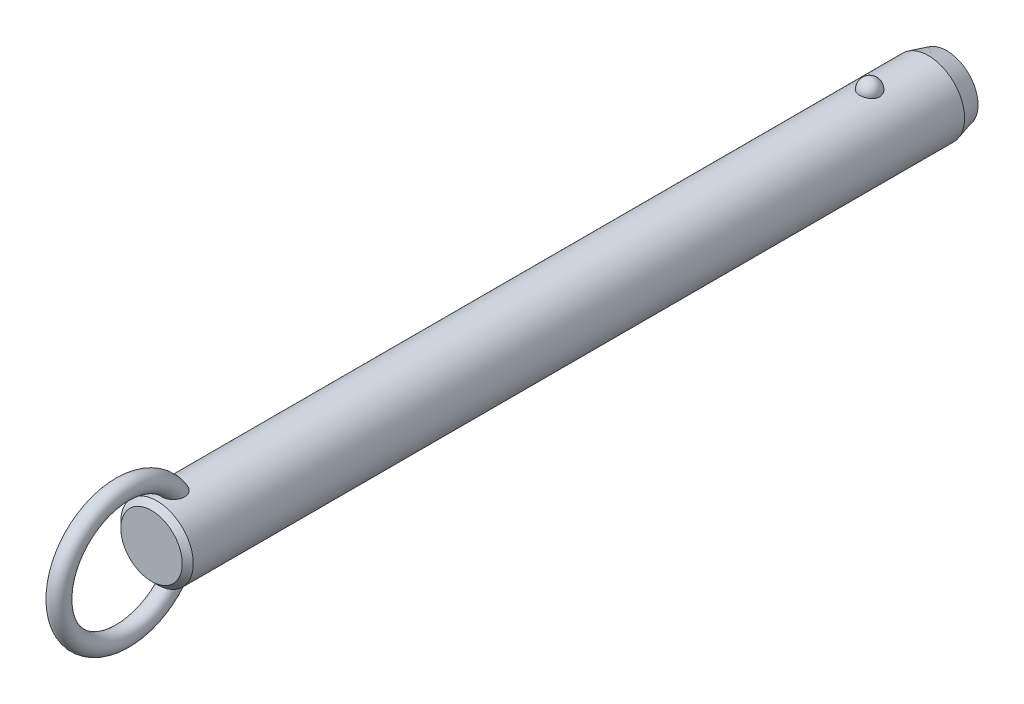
ISO-10303-21;
HEADER;
FILE_DESCRIPTION(('STEP AP214'),'2;1');
FILE_NAME('part.step','',(''),(''),'','','');
FILE_SCHEMA(('AUTOMOTIVE_DESIGN { 1 0 10303 214 1 1 1 1 }'));
ENDSEC;
DATA;
#1=APPLICATION_CONTEXT('core data for automotive mechanical design processes');
#2=APPLICATION_PROTOCOL_DEFINITION('international standard','automotive_design',2000,#1);
#3=PRODUCT_CONTEXT('',#1,'mechanical');
#4=PRODUCT('Part','Part','',(#3));
#5=PRODUCT_RELATED_PRODUCT_CATEGORY('part','',(#4));
#6=PRODUCT_DEFINITION_FORMATION('','',#4);
#7=PRODUCT_DEFINITION_CONTEXT('part definition',#1,'design');
#8=PRODUCT_DEFINITION('design','',#6,#7);
#9=PRODUCT_DEFINITION_SHAPE('','',#8);
#10=(LENGTH_UNIT() NAMED_UNIT(*) SI_UNIT(.MILLI.,.METRE.));
#11=(NAMED_UNIT(*) PLANE_ANGLE_UNIT() SI_UNIT($,.RADIAN.));
#12=(NAMED_UNIT(*) SI_UNIT($,.STERADIAN.) SOLID_ANGLE_UNIT());
#13=UNCERTAINTY_MEASURE_WITH_UNIT(LENGTH_MEASURE(1.E-05),#10,'distance_accuracy_value','');
#14=(GEOMETRIC_REPRESENTATION_CONTEXT(3) GLOBAL_UNCERTAINTY_ASSIGNED_CONTEXT((#13)) GLOBAL_UNIT_ASSIGNED_CONTEXT((#10,
#11,#12)) REPRESENTATION_CONTEXT('',''));
#15=CARTESIAN_POINT('',(0.,0.,0.));
#16=DIRECTION('',(0.,0.,1.));
#17=DIRECTION('',(1.,0.,0.));
#18=AXIS2_PLACEMENT_3D('',#15,#16,#17);
#19=CARTESIAN_POINT('',(0.,0.,144.8));
#20=DIRECTION('',(0.,0.,-1.));
#21=DIRECTION('',(-1.,0.,0.));
#22=AXIS2_PLACEMENT_3D('',#19,#20,#21);
#23=CYLINDRICAL_SURFACE('',#22,7.9);
#24=CARTESIAN_POINT('',(2.1785689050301,7.59367088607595,-2.19999999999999));
#25=CARTESIAN_POINT('',(2.17856679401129,7.59367269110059,-2.07701843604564));
#26=CARTESIAN_POINT('',(2.16853481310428,7.59657145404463,-1.95401006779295));
#27=CARTESIAN_POINT('',(2.12864689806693,7.607843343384,-1.71147811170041));
#28=CARTESIAN_POINT('',(2.09878338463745,7.61621856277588,-1.59195587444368));
#29=CARTESIAN_POINT('',(2.0199931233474,7.63749180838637,-1.3598563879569));
#30=CARTESIAN_POINT('',(1.97107475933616,7.65038784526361,-1.24727610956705));
#31=CARTESIAN_POINT('',(1.85539377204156,7.67926115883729,-1.03213234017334));
#32=CARTESIAN_POINT('',(1.78863158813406,7.69523835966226,-0.929568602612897));
#33=CARTESIAN_POINT('',(1.63856494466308,7.7285848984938,-0.736786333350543));
#34=CARTESIAN_POINT('',(1.55518140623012,7.7459606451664,-0.646630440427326));
#35=CARTESIAN_POINT('',(1.37422937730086,7.78009978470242,-0.481747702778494));
#36=CARTESIAN_POINT('',(1.27666086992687,7.79686317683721,-0.407020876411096));
#37=CARTESIAN_POINT('',(1.07024728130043,7.82786153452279,-0.275278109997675));
#38=CARTESIAN_POINT('',(0.961434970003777,7.84210353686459,-0.218212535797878));
#39=CARTESIAN_POINT('',(0.735351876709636,7.86652194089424,-0.123146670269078));
#40=CARTESIAN_POINT('',(0.618082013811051,7.87669878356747,-0.0851443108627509));
#41=CARTESIAN_POINT('',(0.380637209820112,7.89170521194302,-0.0298158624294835));
#42=CARTESIAN_POINT('',(0.260550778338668,7.89662650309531,-0.0121347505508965));
#43=CARTESIAN_POINT('',(0.019011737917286,7.90090003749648,0.00324379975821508));
#44=CARTESIAN_POINT('',(-0.10244074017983,7.90025280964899,0.000943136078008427));
#45=CARTESIAN_POINT('',(-0.341452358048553,7.89351056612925,-0.0233955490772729));
#46=CARTESIAN_POINT('',(-0.459042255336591,7.88749257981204,-0.0451545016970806));
#47=CARTESIAN_POINT('',(-0.688796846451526,7.87075812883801,-0.107408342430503));
#48=CARTESIAN_POINT('',(-0.800961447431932,7.86004158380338,-0.147903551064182));
#49=CARTESIAN_POINT('',(-1.01743634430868,7.83497131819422,-0.246799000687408));
#50=CARTESIAN_POINT('',(-1.12169791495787,7.82059709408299,-0.305300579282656));
#51=CARTESIAN_POINT('',(-1.31891765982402,7.78976470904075,-0.43854939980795));
#52=CARTESIAN_POINT('',(-1.41187469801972,7.77330633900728,-0.513298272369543));
#53=CARTESIAN_POINT('',(-1.58577142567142,7.73972434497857,-0.678622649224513));
#54=CARTESIAN_POINT('',(-1.66645140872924,7.72259402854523,-0.769470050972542));
#55=CARTESIAN_POINT('',(-1.81161503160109,7.68983776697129,-0.963538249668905));
#56=CARTESIAN_POINT('',(-1.87609753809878,7.6742119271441,-1.06675991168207));
#57=CARTESIAN_POINT('',(-1.98790138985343,7.6460202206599,-1.28401170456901));
#58=CARTESIAN_POINT('',(-2.03501994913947,7.63349104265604,-1.39815107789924));
#59=CARTESIAN_POINT('',(-2.10986724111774,7.6131449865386,-1.63301784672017));
#60=CARTESIAN_POINT('',(-2.1375965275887,7.60532797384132,-1.75374505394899));
#61=CARTESIAN_POINT('',(-2.17289256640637,7.5953195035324,-1.99782562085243));
#62=CARTESIAN_POINT('',(-2.18054294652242,7.59310471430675,-2.12116592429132));
#63=CARTESIAN_POINT('',(-2.17572919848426,7.59448538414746,-2.36741799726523));
#64=CARTESIAN_POINT('',(-2.1632656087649,7.59808068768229,-2.49032977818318));
#65=CARTESIAN_POINT('',(-2.11865035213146,7.61064035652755,-2.73161015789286));
#66=CARTESIAN_POINT('',(-2.08659579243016,7.61957823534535,-2.84999812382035));
#67=CARTESIAN_POINT('',(-2.00367799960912,7.64179982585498,-3.07955956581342));
#68=CARTESIAN_POINT('',(-1.9528140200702,7.65508371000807,-3.19073275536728));
#69=CARTESIAN_POINT('',(-1.83321113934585,7.68460381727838,-3.40337899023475));
#70=CARTESIAN_POINT('',(-1.76437735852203,7.70085556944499,-3.50479651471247));
#71=CARTESIAN_POINT('',(-1.61069526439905,7.73445734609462,-3.69446912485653));
#72=CARTESIAN_POINT('',(-1.52584634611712,7.75180741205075,-3.78272371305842));
#73=CARTESIAN_POINT('',(-1.34198059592,7.78574608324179,-3.94393987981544));
#74=CARTESIAN_POINT('',(-1.24291308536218,7.80233167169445,-4.01684434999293));
#75=CARTESIAN_POINT('',(-1.03352039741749,7.83281625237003,-4.14489386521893));
#76=CARTESIAN_POINT('',(-0.923196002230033,7.84671543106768,-4.20004014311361));
#77=CARTESIAN_POINT('',(-0.69582211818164,7.87011575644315,-4.29042017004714));
#78=CARTESIAN_POINT('',(-0.578872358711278,7.87966903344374,-4.32589112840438));
#79=CARTESIAN_POINT('',(-0.34041023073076,7.8935652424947,-4.37692226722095));
#80=CARTESIAN_POINT('',(-0.218898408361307,7.89790879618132,-4.39248482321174));
#81=CARTESIAN_POINT('',(0.0228107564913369,7.90087453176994,-4.40314405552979));
#82=CARTESIAN_POINT('',(0.142990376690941,7.89960185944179,-4.39861683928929));
#83=CARTESIAN_POINT('',(0.380829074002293,7.89171262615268,-4.37008293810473));
#84=CARTESIAN_POINT('',(0.498488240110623,7.8850962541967,-4.34607694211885));
#85=CARTESIAN_POINT('',(0.727535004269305,7.86726442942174,-4.27939317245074));
#86=CARTESIAN_POINT('',(0.838944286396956,7.85606616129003,-4.236785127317));
#87=CARTESIAN_POINT('',(1.05295421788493,7.83025654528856,-4.13408348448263));
#88=CARTESIAN_POINT('',(1.15555431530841,7.81564498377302,-4.07398879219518));
#89=CARTESIAN_POINT('',(1.35076763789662,7.7843022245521,-3.93687432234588));
#90=CARTESIAN_POINT('',(1.4432046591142,7.76754209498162,-3.85961036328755));
#91=CARTESIAN_POINT('',(1.6139111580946,7.73387857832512,-3.69076949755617));
#92=CARTESIAN_POINT('',(1.6921781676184,7.71697516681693,-3.59919010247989));
#93=CARTESIAN_POINT('',(1.83380875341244,7.6845643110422,-3.40247278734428));
#94=CARTESIAN_POINT('',(1.89689280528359,7.66908588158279,-3.29712873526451));
#95=CARTESIAN_POINT('',(2.0047823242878,7.64159441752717,-3.07707931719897));
#96=CARTESIAN_POINT('',(2.0495945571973,7.62958010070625,-2.96237743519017));
#97=CARTESIAN_POINT('',(2.11580183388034,7.61146617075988,-2.74040519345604));
#98=CARTESIAN_POINT('',(2.13929812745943,7.60484503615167,-2.63379846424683));
#99=CARTESIAN_POINT('',(2.17068242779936,7.59594664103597,-2.41813481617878));
#100=CARTESIAN_POINT('',(2.17857077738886,7.59366928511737,-2.30907795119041));
#101=CARTESIAN_POINT('',(2.1785689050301,7.59367088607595,-2.19999999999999));
#102=B_SPLINE_CURVE_WITH_KNOTS('',3,(#24,#25,#26,#27,#28,#29,#30,#31,#32,#33,#34,#35,#36,#37,
#38,#39,#40,#41,#42,#43,#44,#45,#46,#47,#48,#49,#50,#51,#52,#53,#54,#55,#56,#57,#58,#59,#60,#61,
#62,#63,#64,#65,#66,#67,#68,#69,#70,#71,#72,#73,#74,#75,#76,#77,#78,#79,#80,#81,#82,#83,#84,#85,
#86,#87,#88,#89,#90,#91,#92,#93,#94,#95,#96,#97,#98,#99,#100,#101),.UNSPECIFIED.,.T.,.F.,(4,2,2,
2,2,2,2,2,2,2,2,2,2,2,2,2,2,2,2,2,2,2,2,2,2,2,2,2,2,2,2,2,2,2,2,2,2,2,4),(0.,0.368552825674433,
0.737246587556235,1.10577831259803,1.4743009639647,1.84462067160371,2.21494081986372,
2.58421058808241,2.95344028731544,3.31611630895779,3.67875788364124,4.03628044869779,
4.39380913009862,4.75338791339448,5.11300280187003,5.47939989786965,5.8458226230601,
6.21639834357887,6.58696347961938,6.95598276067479,7.32499216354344,7.69218715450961,
8.0593967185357,8.42858578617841,8.79778880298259,9.16834203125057,9.5388695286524,
9.90482699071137,10.2707407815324,10.6298333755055,10.9889132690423,11.3466585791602,
11.7044262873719,12.0676511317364,12.4309391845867,12.8004764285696,13.1698767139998,
13.4967701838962,13.8236564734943),.UNSPECIFIED.);
#103=CARTESIAN_POINT('',(2.1785689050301,7.59367088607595,-2.19999999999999));
#104=VERTEX_POINT('',#103);
#105=EDGE_CURVE('E41',#104,#104,#102,.T.);
#106=ORIENTED_EDGE('',*,*,#105,.T.);
#107=EDGE_LOOP('',(#106));
#108=FACE_BOUND('',#107,.T.);
#109=CARTESIAN_POINT('',(0.,0.,153.12));
#110=DIRECTION('',(0.,0.,1.));
#111=DIRECTION('',(1.,0.,0.));
#112=AXIS2_PLACEMENT_3D('',#109,#110,#111);
#113=CIRCLE('',#112,7.9);
#114=CARTESIAN_POINT('',(-7.90000000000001,0.,153.12));
#115=VERTEX_POINT('',#114);
#116=EDGE_CURVE('E10',#115,#115,#113,.F.);
#117=ORIENTED_EDGE('',*,*,#116,.T.);
#118=EDGE_LOOP('',(#117));
#119=FACE_BOUND('',#118,.T.);
#120=CARTESIAN_POINT('',(-0.630969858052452,-7.87476203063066,147.012432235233));
#121=CARTESIAN_POINT('',(-0.734180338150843,-7.86648998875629,147.047285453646));
#122=CARTESIAN_POINT('',(-0.834476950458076,-7.85639291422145,147.090816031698));
#123=CARTESIAN_POINT('',(-1.02620356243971,-7.83366343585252,147.194094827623));
#124=CARTESIAN_POINT('',(-1.1176141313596,-7.82102565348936,147.253877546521));
#125=CARTESIAN_POINT('',(-1.28877277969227,-7.79464922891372,147.387839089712));
#126=CARTESIAN_POINT('',(-1.36854014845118,-7.78091246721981,147.461993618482));
#127=CARTESIAN_POINT('',(-1.51461521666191,-7.75380398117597,147.622494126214));
#128=CARTESIAN_POINT('',(-1.58092966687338,-7.74043207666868,147.708833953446));
#129=CARTESIAN_POINT('',(-1.70019064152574,-7.7151252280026,147.892978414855));
#130=CARTESIAN_POINT('',(-1.75284037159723,-7.70322473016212,147.990979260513));
#131=CARTESIAN_POINT('',(-1.84263464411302,-7.68224112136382,148.194102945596));
#132=CARTESIAN_POINT('',(-1.87977299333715,-7.6731591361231,148.299228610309));
#133=CARTESIAN_POINT('',(-1.94152728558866,-7.65777930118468,148.523284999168));
#134=CARTESIAN_POINT('',(-1.96475471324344,-7.65179654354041,148.642616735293));
#135=CARTESIAN_POINT('',(-1.99449499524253,-7.64409642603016,148.88342986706));
#136=CARTESIAN_POINT('',(-2.0010005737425,-7.64238092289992,149.004912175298));
#137=CARTESIAN_POINT('',(-1.99856014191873,-7.64302120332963,149.268340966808));
#138=CARTESIAN_POINT('',(-1.98680021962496,-7.64611845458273,149.41025654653));
#139=CARTESIAN_POINT('',(-1.94457772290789,-7.65696186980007,149.691118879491));
#140=CARTESIAN_POINT('',(-1.91409393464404,-7.66471330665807,149.830062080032));
#141=CARTESIAN_POINT('',(-1.82768670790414,-7.68582947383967,150.131939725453));
#142=CARTESIAN_POINT('',(-1.76772963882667,-7.70003779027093,150.293686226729));
#143=CARTESIAN_POINT('',(-1.65998501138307,-7.72371550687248,150.527695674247));
#144=CARTESIAN_POINT('',(-1.621079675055,-7.73200670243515,150.604297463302));
#145=CARTESIAN_POINT('',(-1.53727726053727,-7.74910377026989,150.754079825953));
#146=CARTESIAN_POINT('',(-1.49238215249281,-7.75790947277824,150.827261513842));
#147=CARTESIAN_POINT('',(-1.37397050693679,-7.77993338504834,151.00288382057));
#148=CARTESIAN_POINT('',(-1.29690364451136,-7.79328473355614,151.102955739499));
#149=CARTESIAN_POINT('',(-1.1288548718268,-7.81939266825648,151.290714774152));
#150=CARTESIAN_POINT('',(-1.0378992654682,-7.83215032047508,151.378424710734));
#151=CARTESIAN_POINT('',(-0.86953281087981,-7.85231710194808,151.513414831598));
#152=CARTESIAN_POINT('',(-0.795716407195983,-7.86021093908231,151.565076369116));
#153=CARTESIAN_POINT('',(-0.640813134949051,-7.87434920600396,151.656381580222));
#154=CARTESIAN_POINT('',(-0.559737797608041,-7.88059619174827,151.69604389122));
#155=CARTESIAN_POINT('',(-0.406456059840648,-7.88984116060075,151.754300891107));
#156=CARTESIAN_POINT('',(-0.335227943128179,-7.89321892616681,151.775384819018));
#157=CARTESIAN_POINT('',(-0.190193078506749,-7.89804235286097,151.80541418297));
#158=CARTESIAN_POINT('',(-0.11638863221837,-7.89948969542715,151.814370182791));
#159=CARTESIAN_POINT('',(0.0318414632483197,-7.90028409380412,151.819291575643));
#160=CARTESIAN_POINT('',(0.106268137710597,-7.89962640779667,151.815227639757));
#161=CARTESIAN_POINT('',(0.253290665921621,-7.8962818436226,151.794461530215));
#162=CARTESIAN_POINT('',(0.325885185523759,-7.8935935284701,151.777750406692));
#163=CARTESIAN_POINT('',(0.481441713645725,-7.88577340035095,151.728738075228));
#164=CARTESIAN_POINT('',(0.563611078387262,-7.88026321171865,151.694005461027));
#165=CARTESIAN_POINT('',(0.721129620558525,-7.86741729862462,151.611796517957));
#166=CARTESIAN_POINT('',(0.796466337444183,-7.86007832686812,151.564297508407));
#167=CARTESIAN_POINT('',(0.971456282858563,-7.84073285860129,151.436513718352));
#168=CARTESIAN_POINT('',(1.0671968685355,-7.82809461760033,151.351004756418));
#169=CARTESIAN_POINT('',(1.24418921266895,-7.80192439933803,151.166232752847));
#170=CARTESIAN_POINT('',(1.32540832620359,-7.78839049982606,151.066939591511));
#171=CARTESIAN_POINT('',(1.45199971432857,-7.76559693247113,150.889576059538));
#172=CARTESIAN_POINT('',(1.5008564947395,-7.75626094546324,150.813954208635));
#173=CARTESIAN_POINT('',(1.59197749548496,-7.7380727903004,150.658742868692));
#174=CARTESIAN_POINT('',(1.63423919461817,-7.72922080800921,150.579151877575));
#175=CARTESIAN_POINT('',(1.71222612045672,-7.71231959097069,150.416664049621));
#176=CARTESIAN_POINT('',(1.74794516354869,-7.70427111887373,150.333764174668));
#177=CARTESIAN_POINT('',(1.81270113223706,-7.68929240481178,150.165296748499));
#178=CARTESIAN_POINT('',(1.84173789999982,-7.68236218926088,150.079729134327));
#179=CARTESIAN_POINT('',(1.89322698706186,-7.6698375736,149.90528702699));
#180=CARTESIAN_POINT('',(1.91558744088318,-7.66426199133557,149.816383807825));
#181=CARTESIAN_POINT('',(1.95281367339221,-7.65485915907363,149.636969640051));
#182=CARTESIAN_POINT('',(1.96767946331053,-7.65103190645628,149.546458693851));
#183=CARTESIAN_POINT('',(2.00021456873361,-7.64262981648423,149.273732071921));
#184=CARTESIAN_POINT('',(2.00600691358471,-7.6410871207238,149.089709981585));
#185=CARTESIAN_POINT('',(1.98445334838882,-7.64669564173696,148.776501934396));
#186=CARTESIAN_POINT('',(1.96607186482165,-7.65149688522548,148.646618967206));
#187=CARTESIAN_POINT('',(1.90884967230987,-7.6659762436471,148.391632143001));
#188=CARTESIAN_POINT('',(1.87002101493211,-7.67565148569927,148.266525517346));
#189=CARTESIAN_POINT('',(1.77063986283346,-7.69918471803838,148.02454013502));
#190=CARTESIAN_POINT('',(1.70993724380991,-7.71307150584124,147.907725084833));
#191=CARTESIAN_POINT('',(1.56733070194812,-7.74330306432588,147.688144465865));
#192=CARTESIAN_POINT('',(1.48543692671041,-7.75964665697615,147.585372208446));
#193=CARTESIAN_POINT('',(1.31346177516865,-7.79047523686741,147.409380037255));
#194=CARTESIAN_POINT('',(1.22547278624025,-7.80495298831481,147.334106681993));
#195=CARTESIAN_POINT('',(1.03724352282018,-7.83218597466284,147.200486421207));
#196=CARTESIAN_POINT('',(0.93700840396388,-7.84494192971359,147.142132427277));
#197=CARTESIAN_POINT('',(0.733599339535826,-7.86649045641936,147.047027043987));
#198=CARTESIAN_POINT('',(0.630941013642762,-7.87547134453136,147.009210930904));
#199=CARTESIAN_POINT('',(0.420465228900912,-7.88950708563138,146.951116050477));
#200=CARTESIAN_POINT('',(0.312645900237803,-7.89456050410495,146.93084369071));
#201=CARTESIAN_POINT('',(0.096086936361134,-7.9001518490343,146.908455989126));
#202=CARTESIAN_POINT('',(-0.0126341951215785,-7.90073226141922,146.906169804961));
#203=CARTESIAN_POINT('',(-0.228766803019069,-7.89742350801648,146.919367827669));
#204=CARTESIAN_POINT('',(-0.336180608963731,-7.89354403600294,146.934813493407));
#205=CARTESIAN_POINT('',(-0.473410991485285,-7.88586871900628,146.966217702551));
#206=CARTESIAN_POINT('',(-0.505257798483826,-7.88388984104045,146.974354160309));
#207=CARTESIAN_POINT('',(-0.568481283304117,-7.87958326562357,146.992208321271));
#208=CARTESIAN_POINT('',(-0.599857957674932,-7.87725556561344,147.001926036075));
#209=CARTESIAN_POINT('',(-0.630969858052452,-7.87476203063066,147.012432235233));
#210=B_SPLINE_CURVE_WITH_KNOTS('',3,(#120,#121,#122,#123,#124,#125,#126,#127,#128,#129,#130,
#131,#132,#133,#134,#135,#136,#137,#138,#139,#140,#141,#142,#143,#144,#145,#146,#147,#148,#149,
#150,#151,#152,#153,#154,#155,#156,#157,#158,#159,#160,#161,#162,#163,#164,#165,#166,#167,#168,
#169,#170,#171,#172,#173,#174,#175,#176,#177,#178,#179,#180,#181,#182,#183,#184,#185,#186,#187,
#188,#189,#190,#191,#192,#193,#194,#195,#196,#197,#198,#199,#200,#201,#202,#203,#204,#205,#206,
#207,#208,#209),.UNSPECIFIED.,.T.,.F.,(4,2,2,2,2,2,2,2,2,2,2,2,2,2,2,2,2,2,2,2,2,2,2,2,2,2,2,2,
2,2,2,2,2,2,2,2,2,2,2,2,2,2,2,2,4),(0.,0.327622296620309,0.655945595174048,0.983718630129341,
1.3113267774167,1.64554655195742,1.97989964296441,2.34365728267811,2.70757317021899,
3.13333684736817,3.55958380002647,4.07655306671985,4.33527897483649,4.59391999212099,
4.9738243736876,5.35301797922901,5.62348245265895,5.89352465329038,6.11565959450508,
6.33760092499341,6.56004255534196,6.78264174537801,7.0493084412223,7.31645206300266,
7.7013087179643,8.08701995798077,8.35824509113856,8.62957365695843,8.9011573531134,
9.1727474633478,9.44791855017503,9.72308922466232,10.2715298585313,10.6638393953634,
11.0559179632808,11.4507403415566,11.8453740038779,12.1936425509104,12.5417649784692,
12.8695063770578,13.1973674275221,13.5221104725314,13.8461490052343,13.9449071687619,
14.0436660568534),.UNSPECIFIED.);
#211=CARTESIAN_POINT('',(-0.630969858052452,-7.87476203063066,147.012432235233));
#212=VERTEX_POINT('',#211);
#213=EDGE_CURVE('E59',#212,#212,#210,.T.);
#214=ORIENTED_EDGE('',*,*,#213,.T.);
#215=EDGE_LOOP('',(#214));
#216=FACE_BOUND('',#215,.T.);
#217=CARTESIAN_POINT('',(-0.630969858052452,7.87476203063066,147.012432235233));
#218=CARTESIAN_POINT('',(-0.52891882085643,7.88293636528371,146.977979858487));
#219=CARTESIAN_POINT('',(-0.423745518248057,7.88934810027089,146.951915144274));
#220=CARTESIAN_POINT('',(-0.210236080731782,7.8979273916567,146.917282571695));
#221=CARTESIAN_POINT('',(-0.101893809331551,7.90008607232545,146.908751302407));
#222=CARTESIAN_POINT('',(0.11466056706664,7.89990877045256,146.909457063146));
#223=CARTESIAN_POINT('',(0.222872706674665,7.89757640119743,146.91867980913));
#224=CARTESIAN_POINT('',(0.436107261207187,7.88867538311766,146.954652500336));
#225=CARTESIAN_POINT('',(0.541131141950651,7.8821087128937,146.98139425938));
#226=CARTESIAN_POINT('',(0.745085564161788,7.86545130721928,147.051756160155));
#227=CARTESIAN_POINT('',(0.844015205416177,7.85536005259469,147.095378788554));
#228=CARTESIAN_POINT('',(1.03299167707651,7.83275153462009,147.198379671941));
#229=CARTESIAN_POINT('',(1.12303841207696,7.8202342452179,147.257758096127));
#230=CARTESIAN_POINT('',(1.29214734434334,7.79408219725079,147.390864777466));
#231=CARTESIAN_POINT('',(1.37116907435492,7.78044359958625,147.464643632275));
#232=CARTESIAN_POINT('',(1.51597677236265,7.75353170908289,147.624235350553));
#233=CARTESIAN_POINT('',(1.58176261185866,7.74025841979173,147.710048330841));
#234=CARTESIAN_POINT('',(1.70057386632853,7.71504069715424,147.893644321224));
#235=CARTESIAN_POINT('',(1.75320073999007,7.7031425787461,147.991690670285));
#236=CARTESIAN_POINT('',(1.8429376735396,7.68216822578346,148.194893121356));
#237=CARTESIAN_POINT('',(1.88004278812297,7.67309289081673,148.300051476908));
#238=CARTESIAN_POINT('',(1.9417232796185,7.6577294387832,148.524167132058));
#239=CARTESIAN_POINT('',(1.96491037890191,7.65175648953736,148.643524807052));
#240=CARTESIAN_POINT('',(1.9945689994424,7.64407702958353,148.884384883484));
#241=CARTESIAN_POINT('',(2.00103304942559,7.64237242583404,149.00588821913));
#242=CARTESIAN_POINT('',(1.99850166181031,7.64303650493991,149.269368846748));
#243=CARTESIAN_POINT('',(1.98669038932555,7.64614714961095,149.411314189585));
#244=CARTESIAN_POINT('',(1.94436120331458,7.6570170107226,149.692228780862));
#245=CARTESIAN_POINT('',(1.91382203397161,7.66478150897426,149.831194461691));
#246=CARTESIAN_POINT('',(1.82728754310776,7.68592483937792,150.133111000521));
#247=CARTESIAN_POINT('',(1.76725778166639,7.7001468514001,150.294872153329));
#248=CARTESIAN_POINT('',(1.65939700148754,7.72384204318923,150.528891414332));
#249=CARTESIAN_POINT('',(1.62045187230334,7.73213852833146,150.605494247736));
#250=CARTESIAN_POINT('',(1.53656684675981,7.74924489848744,150.755273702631));
#251=CARTESIAN_POINT('',(1.49162892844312,7.75805461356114,150.828451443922));
#252=CARTESIAN_POINT('',(1.37317698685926,7.78007342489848,151.003952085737));
#253=CARTESIAN_POINT('',(1.29612360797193,7.79341423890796,151.103911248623));
#254=CARTESIAN_POINT('',(1.12812043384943,7.81949839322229,151.29145083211));
#255=CARTESIAN_POINT('',(1.03719688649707,7.83224280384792,151.379054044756));
#256=CARTESIAN_POINT('',(0.868871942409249,7.85239026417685,151.51389715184));
#257=CARTESIAN_POINT('',(0.79505627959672,7.86027769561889,151.565511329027));
#258=CARTESIAN_POINT('',(0.640160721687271,7.87440222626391,151.656720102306));
#259=CARTESIAN_POINT('',(0.559092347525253,7.88064188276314,151.696333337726));
#260=CARTESIAN_POINT('',(0.405820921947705,7.8898738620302,151.754505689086));
#261=CARTESIAN_POINT('',(0.334594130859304,7.89324577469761,151.775552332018));
#262=CARTESIAN_POINT('',(0.189568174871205,7.89805733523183,151.805507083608));
#263=CARTESIAN_POINT('',(0.115771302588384,7.89949866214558,151.814425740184));
#264=CARTESIAN_POINT('',(-0.0324359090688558,7.90028156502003,151.81927589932));
#265=CARTESIAN_POINT('',(-0.106847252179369,7.89961843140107,151.815178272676));
#266=CARTESIAN_POINT('',(-0.253834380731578,7.8962642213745,151.794351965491));
#267=CARTESIAN_POINT('',(-0.326408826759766,7.89357170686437,151.777614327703));
#268=CARTESIAN_POINT('',(-0.481962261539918,7.88574179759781,151.728539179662));
#269=CARTESIAN_POINT('',(-0.564145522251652,7.88022507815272,151.693763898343));
#270=CARTESIAN_POINT('',(-0.721685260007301,7.86736646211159,151.611468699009));
#271=CARTESIAN_POINT('',(-0.79702924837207,7.8600213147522,151.563926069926));
#272=CARTESIAN_POINT('',(-0.972044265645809,7.84066026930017,151.436026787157));
#273=CARTESIAN_POINT('',(-1.06779803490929,7.828012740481,151.350443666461));
#274=CARTESIAN_POINT('',(-1.24480531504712,7.80182621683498,151.165522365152));
#275=CARTESIAN_POINT('',(-1.32602618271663,7.78828530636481,151.066154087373));
#276=CARTESIAN_POINT('',(-1.4525983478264,7.76548487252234,150.888680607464));
#277=CARTESIAN_POINT('',(-1.50143856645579,7.75614818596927,150.813025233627));
#278=CARTESIAN_POINT('',(-1.59252410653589,7.73796020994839,150.657748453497));
#279=CARTESIAN_POINT('',(-1.63476690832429,7.729109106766,150.578125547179));
#280=CARTESIAN_POINT('',(-1.7127131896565,7.71221133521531,150.415575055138));
#281=CARTESIAN_POINT('',(-1.74841047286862,7.70416543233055,150.332644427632));
#282=CARTESIAN_POINT('',(-1.81311929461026,7.6891937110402,150.164116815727));
#283=CARTESIAN_POINT('',(-1.84213067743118,7.68226791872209,150.078519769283));
#284=CARTESIAN_POINT('',(-1.89356259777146,7.66975461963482,149.904025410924));
#285=CARTESIAN_POINT('',(-1.91589165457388,7.66418586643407,149.815099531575));
#286=CARTESIAN_POINT('',(-1.9530507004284,7.65479859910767,149.635642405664));
#287=CARTESIAN_POINT('',(-1.96788069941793,7.65098008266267,149.545111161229));
#288=CARTESIAN_POINT('',(-2.00030078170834,7.64260704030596,149.272327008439));
#289=CARTESIAN_POINT('',(-2.00600576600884,7.64108760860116,149.088271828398));
#290=CARTESIAN_POINT('',(-1.9842848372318,7.64673945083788,148.775080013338));
#291=CARTESIAN_POINT('',(-1.96583698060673,7.65155751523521,148.645240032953));
#292=CARTESIAN_POINT('',(-1.90848948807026,7.66606613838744,148.390361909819));
#293=CARTESIAN_POINT('',(-1.86960376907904,7.67575338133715,148.265320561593));
#294=CARTESIAN_POINT('',(-1.77013421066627,7.6993013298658,148.023500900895));
#295=CARTESIAN_POINT('',(-1.70940488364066,7.71318991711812,147.906784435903));
#296=CARTESIAN_POINT('',(-1.5667295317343,7.74342495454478,147.687340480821));
#297=CARTESIAN_POINT('',(-1.48478316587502,7.75977144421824,147.58461321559));
#298=CARTESIAN_POINT('',(-1.31266325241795,7.79061163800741,147.408643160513));
#299=CARTESIAN_POINT('',(-1.22456383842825,7.80509908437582,147.333358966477));
#300=CARTESIAN_POINT('',(-1.03622400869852,7.83231881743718,147.199865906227));
#301=CARTESIAN_POINT('',(-0.936015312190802,7.84505551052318,147.141613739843));
#302=CARTESIAN_POINT('',(-0.798824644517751,7.85957802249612,147.077540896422));
#303=CARTESIAN_POINT('',(-0.765787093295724,7.86286821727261,147.063224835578));
#304=CARTESIAN_POINT('',(-0.698939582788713,7.86909211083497,147.036436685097));
#305=CARTESIAN_POINT('',(-0.665129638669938,7.8720258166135,147.023964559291));
#306=CARTESIAN_POINT('',(-0.630969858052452,7.87476203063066,147.012432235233));
#307=B_SPLINE_CURVE_WITH_KNOTS('',3,(#217,#218,#219,#220,#221,#222,#223,#224,#225,#226,#227,
#228,#229,#230,#231,#232,#233,#234,#235,#236,#237,#238,#239,#240,#241,#242,#243,#244,#245,#246,
#247,#248,#249,#250,#251,#252,#253,#254,#255,#256,#257,#258,#259,#260,#261,#262,#263,#264,#265,
#266,#267,#268,#269,#270,#271,#272,#273,#274,#275,#276,#277,#278,#279,#280,#281,#282,#283,#284,
#285,#286,#287,#288,#289,#290,#291,#292,#293,#294,#295,#296,#297,#298,#299,#300,#301,#302,#303,
#304,#305,#306),.UNSPECIFIED.,.T.,.F.,(4,2,2,2,2,2,2,2,2,2,2,2,2,2,2,2,2,2,2,2,2,2,2,2,2,2,2,2,
2,2,2,2,2,2,2,2,2,2,2,2,2,2,2,2,4),(0.,0.32392037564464,0.648516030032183,0.972850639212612,
1.29703380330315,1.62126473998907,1.94549915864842,2.27089401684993,2.5962920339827,
2.93059633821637,3.26500707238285,3.6288164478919,3.99278833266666,4.41865421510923,
4.84500434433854,5.36209210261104,5.62087589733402,5.87957448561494,6.25918598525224,
6.63808782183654,6.90846748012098,7.17842501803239,7.40052350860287,7.6224287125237,
7.84483086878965,8.0673907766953,8.33414615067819,8.60137921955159,8.98641454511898,
9.37230415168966,9.64358673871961,9.91497268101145,10.1866142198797,10.4582620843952,
10.7334745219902,11.008686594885,11.5572126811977,11.9494246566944,12.3413699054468,
12.7359755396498,13.1305875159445,13.4791770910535,13.82687259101,13.9353013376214,
14.0437279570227),.UNSPECIFIED.);
#308=CARTESIAN_POINT('',(-0.630969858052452,7.87476203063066,147.012432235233));
#309=VERTEX_POINT('',#308);
#310=EDGE_CURVE('E67',#309,#309,#307,.T.);
#311=ORIENTED_EDGE('',*,*,#310,.T.);
#312=EDGE_LOOP('',(#311));
#313=FACE_BOUND('',#312,.T.);
#314=CARTESIAN_POINT('',(0.,0.,-15.0000000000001));
#315=DIRECTION('',(0.,0.,-1.));
#316=DIRECTION('',(-1.,0.,0.));
#317=AXIS2_PLACEMENT_3D('',#314,#315,#316);
#318=CIRCLE('',#317,7.9);
#319=CARTESIAN_POINT('',(-7.9,0.,-15.0000000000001));
#320=VERTEX_POINT('',#319);
#321=EDGE_CURVE('E56',#320,#320,#318,.F.);
#322=ORIENTED_EDGE('',*,*,#321,.T.);
#323=EDGE_LOOP('',(#322));
#324=FACE_BOUND('',#323,.T.);
#325=ADVANCED_FACE('F37',(#108,#119,#216,#313,#324),#23,.T.);
#326=CARTESIAN_POINT('',(0.,0.,-19.));
#327=DIRECTION('',(0.,0.,-1.));
#328=DIRECTION('',(-1.,0.,0.));
#329=AXIS2_PLACEMENT_3D('',#326,#327,#328);
#330=PLANE('',#329);
#331=CARTESIAN_POINT('',(0.,0.,-19.));
#332=DIRECTION('',(0.,0.,-1.));
#333=DIRECTION('',(-1.,0.,0.));
#334=AXIS2_PLACEMENT_3D('',#331,#332,#333);
#335=CIRCLE('',#334,6.82820323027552);
#336=CARTESIAN_POINT('',(-6.82820323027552,0.,-19.));
#337=VERTEX_POINT('',#336);
#338=EDGE_CURVE('E66',#337,#337,#335,.T.);
#339=ORIENTED_EDGE('',*,*,#338,.T.);
#340=EDGE_LOOP('',(#339));
#341=FACE_BOUND('',#340,.T.);
#342=ADVANCED_FACE('F85',(#341),#330,.T.);
#343=CARTESIAN_POINT('',(0.,0.,-19.));
#344=DIRECTION('',(0.,0.,1.));
#345=DIRECTION('',(1.,0.,0.));
#346=AXIS2_PLACEMENT_3D('',#343,#344,#345);
#347=CONICAL_SURFACE('',#346,6.82820323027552,0.261799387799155);
#348=ORIENTED_EDGE('',*,*,#321,.F.);
#349=EDGE_LOOP('',(#348));
#350=FACE_BOUND('',#349,.T.);
#351=ORIENTED_EDGE('',*,*,#338,.F.);
#352=EDGE_LOOP('',(#351));
#353=FACE_BOUND('',#352,.T.);
#354=ADVANCED_FACE('F83',(#350,#353),#347,.T.);
#355=CARTESIAN_POINT('',(0.,0.,154.32));
#356=DIRECTION('',(0.,0.,1.));
#357=DIRECTION('',(1.,0.,0.));
#358=AXIS2_PLACEMENT_3D('',#355,#356,#357);
#359=PLANE('',#358);
#360=CARTESIAN_POINT('',(0.,0.,154.32));
#361=DIRECTION('',(0.,0.,1.));
#362=DIRECTION('',(1.,0.,0.));
#363=AXIS2_PLACEMENT_3D('',#360,#361,#362);
#364=CIRCLE('',#363,6.7000000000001);
#365=CARTESIAN_POINT('',(-6.70000000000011,0.,154.32));
#366=VERTEX_POINT('',#365);
#367=EDGE_CURVE('E50',#366,#366,#364,.T.);
#368=ORIENTED_EDGE('',*,*,#367,.T.);
#369=EDGE_LOOP('',(#368));
#370=FACE_BOUND('',#369,.T.);
#371=ADVANCED_FACE('F77',(#370),#359,.T.);
#372=CARTESIAN_POINT('',(0.,0.,160.65));
#373=DIRECTION('',(1.,0.,0.));
#374=DIRECTION('',(0.,0.,-1.));
#375=AXIS2_PLACEMENT_3D('',#372,#373,#374);
#376=TOROIDAL_SURFACE('',#375,13.85,2.);
#377=ORIENTED_EDGE('',*,*,#310,.F.);
#378=EDGE_LOOP('',(#377));
#379=FACE_BOUND('',#378,.T.);
#380=ORIENTED_EDGE('',*,*,#213,.F.);
#381=EDGE_LOOP('',(#380));
#382=FACE_BOUND('',#381,.T.);
#383=ADVANCED_FACE('F73',(#379,#382),#376,.T.);
#384=CARTESIAN_POINT('',(0.,0.,154.32));
#385=DIRECTION('',(0.,0.,-1.));
#386=DIRECTION('',(-1.,0.,0.));
#387=AXIS2_PLACEMENT_3D('',#384,#385,#386);
#388=CONICAL_SURFACE('',#387,6.7000000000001,0.785398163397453);
#389=CARTESIAN_POINT('',(-7.90000000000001,0.,153.12));
#390=CARTESIAN_POINT('',(-7.88750000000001,0.,153.1325));
#391=CARTESIAN_POINT('',(-7.87500000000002,0.,153.145));
#392=CARTESIAN_POINT('',(-7.85000000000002,0.,153.17));
#393=CARTESIAN_POINT('',(-7.83750000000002,0.,153.1825));
#394=CARTESIAN_POINT('',(-7.81250000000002,0.,153.2075));
#395=CARTESIAN_POINT('',(-7.80000000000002,0.,153.22));
#396=CARTESIAN_POINT('',(-7.77500000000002,0.,153.245));
#397=CARTESIAN_POINT('',(-7.76250000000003,0.,153.2575));
#398=CARTESIAN_POINT('',(-7.73750000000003,0.,153.2825));
#399=CARTESIAN_POINT('',(-7.72500000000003,0.,153.295));
#400=CARTESIAN_POINT('',(-7.70000000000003,0.,153.32));
#401=CARTESIAN_POINT('',(-7.68750000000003,0.,153.3325));
#402=CARTESIAN_POINT('',(-7.66250000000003,0.,153.3575));
#403=CARTESIAN_POINT('',(-7.65000000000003,0.,153.37));
#404=CARTESIAN_POINT('',(-7.62500000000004,0.,153.395));
#405=CARTESIAN_POINT('',(-7.61250000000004,0.,153.4075));
#406=CARTESIAN_POINT('',(-7.58750000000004,0.,153.4325));
#407=CARTESIAN_POINT('',(-7.57500000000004,0.,153.445));
#408=CARTESIAN_POINT('',(-7.55000000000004,0.,153.47));
#409=CARTESIAN_POINT('',(-7.53750000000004,0.,153.4825));
#410=CARTESIAN_POINT('',(-7.51250000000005,0.,153.5075));
#411=CARTESIAN_POINT('',(-7.50000000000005,0.,153.52));
#412=CARTESIAN_POINT('',(-7.47500000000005,0.,153.545));
#413=CARTESIAN_POINT('',(-7.46250000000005,0.,153.5575));
#414=CARTESIAN_POINT('',(-7.43750000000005,0.,153.5825));
#415=CARTESIAN_POINT('',(-7.42500000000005,0.,153.595));
#416=CARTESIAN_POINT('',(-7.40000000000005,0.,153.62));
#417=CARTESIAN_POINT('',(-7.38750000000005,0.,153.6325));
#418=CARTESIAN_POINT('',(-7.36250000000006,0.,153.6575));
#419=CARTESIAN_POINT('',(-7.35000000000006,0.,153.67));
#420=CARTESIAN_POINT('',(-7.32500000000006,0.,153.695));
#421=CARTESIAN_POINT('',(-7.31250000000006,0.,153.7075));
#422=CARTESIAN_POINT('',(-7.28750000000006,0.,153.7325));
#423=CARTESIAN_POINT('',(-7.27500000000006,0.,153.745));
#424=CARTESIAN_POINT('',(-7.25000000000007,0.,153.77));
#425=CARTESIAN_POINT('',(-7.23750000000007,0.,153.7825));
#426=CARTESIAN_POINT('',(-7.21250000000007,0.,153.8075));
#427=CARTESIAN_POINT('',(-7.20000000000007,0.,153.82));
#428=CARTESIAN_POINT('',(-7.17500000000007,0.,153.845));
#429=CARTESIAN_POINT('',(-7.16250000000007,0.,153.8575));
#430=CARTESIAN_POINT('',(-7.13750000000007,0.,153.8825));
#431=CARTESIAN_POINT('',(-7.12500000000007,0.,153.895));
#432=CARTESIAN_POINT('',(-7.10000000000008,0.,153.92));
#433=CARTESIAN_POINT('',(-7.08750000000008,0.,153.9325));
#434=CARTESIAN_POINT('',(-7.06250000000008,0.,153.9575));
#435=CARTESIAN_POINT('',(-7.05000000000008,0.,153.97));
#436=CARTESIAN_POINT('',(-7.02500000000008,0.,153.995));
#437=CARTESIAN_POINT('',(-7.01250000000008,0.,154.0075));
#438=CARTESIAN_POINT('',(-6.98750000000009,0.,154.0325));
#439=CARTESIAN_POINT('',(-6.97500000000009,0.,154.045));
#440=CARTESIAN_POINT('',(-6.95000000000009,0.,154.07));
#441=CARTESIAN_POINT('',(-6.93750000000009,0.,154.0825));
#442=CARTESIAN_POINT('',(-6.91250000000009,0.,154.1075));
#443=CARTESIAN_POINT('',(-6.90000000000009,0.,154.12));
#444=CARTESIAN_POINT('',(-6.8750000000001,0.,154.145));
#445=CARTESIAN_POINT('',(-6.8625000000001,0.,154.1575));
#446=CARTESIAN_POINT('',(-6.8375000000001,0.,154.1825));
#447=CARTESIAN_POINT('',(-6.8250000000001,0.,154.195));
#448=CARTESIAN_POINT('',(-6.8000000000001,0.,154.22));
#449=CARTESIAN_POINT('',(-6.7875000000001,0.,154.2325));
#450=CARTESIAN_POINT('',(-6.7625000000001,0.,154.2575));
#451=CARTESIAN_POINT('',(-6.7500000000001,0.,154.27));
#452=CARTESIAN_POINT('',(-6.7250000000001,0.,154.295));
#453=CARTESIAN_POINT('',(-6.7125000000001,0.,154.3075));
#454=CARTESIAN_POINT('',(-6.70000000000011,0.,154.32));
#455=B_SPLINE_CURVE_WITH_KNOTS('',3,(#389,#390,#391,#392,#393,#394,#395,#396,#397,#398,#399,
#400,#401,#402,#403,#404,#405,#406,#407,#408,#409,#410,#411,#412,#413,#414,#415,#416,#417,#418,
#419,#420,#421,#422,#423,#424,#425,#426,#427,#428,#429,#430,#431,#432,#433,#434,#435,#436,#437,
#438,#439,#440,#441,#442,#443,#444,#445,#446,#447,#448,#449,#450,#451,#452,#453,#454),
.UNSPECIFIED.,.F.,.F.,(4,2,2,2,2,2,2,2,2,2,2,2,2,2,2,2,2,2,2,2,2,2,2,2,2,2,2,2,2,2,2,2,4),(0.,
0.0530330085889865,0.106066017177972,0.159099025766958,0.212132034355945,0.26516504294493,
0.318198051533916,0.371231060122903,0.424264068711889,0.477297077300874,0.530330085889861,
0.583363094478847,0.636396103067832,0.689429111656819,0.742462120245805,0.795495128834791,
0.848528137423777,0.901561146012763,0.954594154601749,1.00762716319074,1.06066017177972,
1.11369318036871,1.16672618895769,1.21975919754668,1.27279220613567,1.32582521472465,
1.37885822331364,1.43189123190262,1.48492424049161,1.5379572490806,1.59099025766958,
1.64402326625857,1.69705627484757),.UNSPECIFIED.);
#456=EDGE_CURVE('BSEAM39',#115,#366,#455,.T.);
#457=ORIENTED_EDGE('',*,*,#116,.F.);
#458=ORIENTED_EDGE('',*,*,#367,.F.);
#459=ORIENTED_EDGE('',*,*,#456,.T.);
#460=ORIENTED_EDGE('',*,*,#456,.F.);
#461=EDGE_LOOP('',(#457,#459,#458,#460));
#462=FACE_BOUND('',#461,.T.);
#463=ADVANCED_FACE('F39',(#462),#388,.T.);
#464=CARTESIAN_POINT('',(0.,7.9,-2.19999999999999));
#465=DIRECTION('',(0.,1.,0.));
#466=DIRECTION('',(0.,0.,1.));
#467=AXIS2_PLACEMENT_3D('',#464,#465,#466);
#468=SPHERICAL_SURFACE('',#467,2.2);
#469=ORIENTED_EDGE('',*,*,#105,.F.);
#470=EDGE_LOOP('',(#469));
#471=FACE_BOUND('',#470,.T.);
#472=ADVANCED_FACE('F79',(#471),#468,.T.);
#473=CLOSED_SHELL('',(#325,#342,#354,#371,#383,#463,#472));
#474=MANIFOLD_SOLID_BREP('B2',#473);
#475=ADVANCED_BREP_SHAPE_REPRESENTATION('',(#18,#474),#14);
#476=SHAPE_DEFINITION_REPRESENTATION(#9,#475);
ENDSEC;
END-ISO-10303-21;
